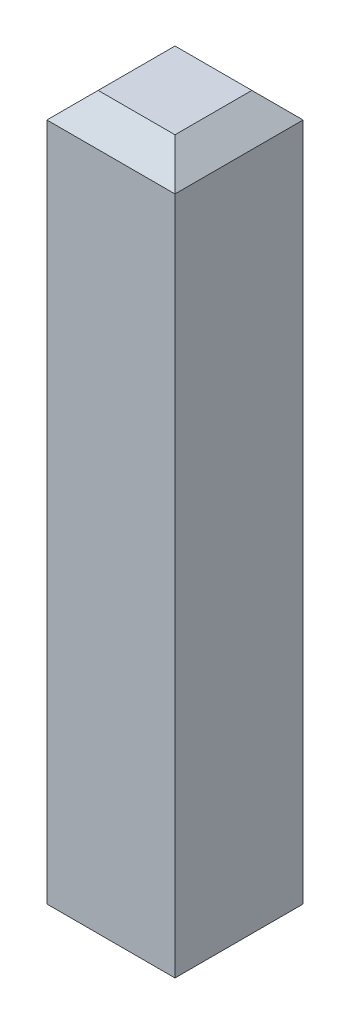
from build123d import *

# Parameters (mm, degrees)
SKETCH1_W           = 0.5
SKETCH1_H           = 0.5
BOSS_EXTRUDE1_DEPTH = 2.75
CHAMFER1_SIZE       = 0.1


with BuildPart() as part:
    # Sketch1 → Boss-Extrude1 (new body)
    with BuildSketch(Plane(origin=(0, 0, 0), x_dir=(1, 0, 0), z_dir=(0, 1, 0))):
        Rectangle(SKETCH1_W, SKETCH1_H)
    extrude(amount=BOSS_EXTRUDE1_DEPTH)

    # Chamfer1
    chamfer1_edges = [part.edges().sort_by_distance(p)[0] for p in [
        (0.25, 2.75, 0),
        (0, 2.75, -0.25),
        (-0.25, 2.75, 0),
        (0, 2.75, 0.25),
    ]]
    chamfer(chamfer1_edges, length=CHAMFER1_SIZE)


solid = part.part
